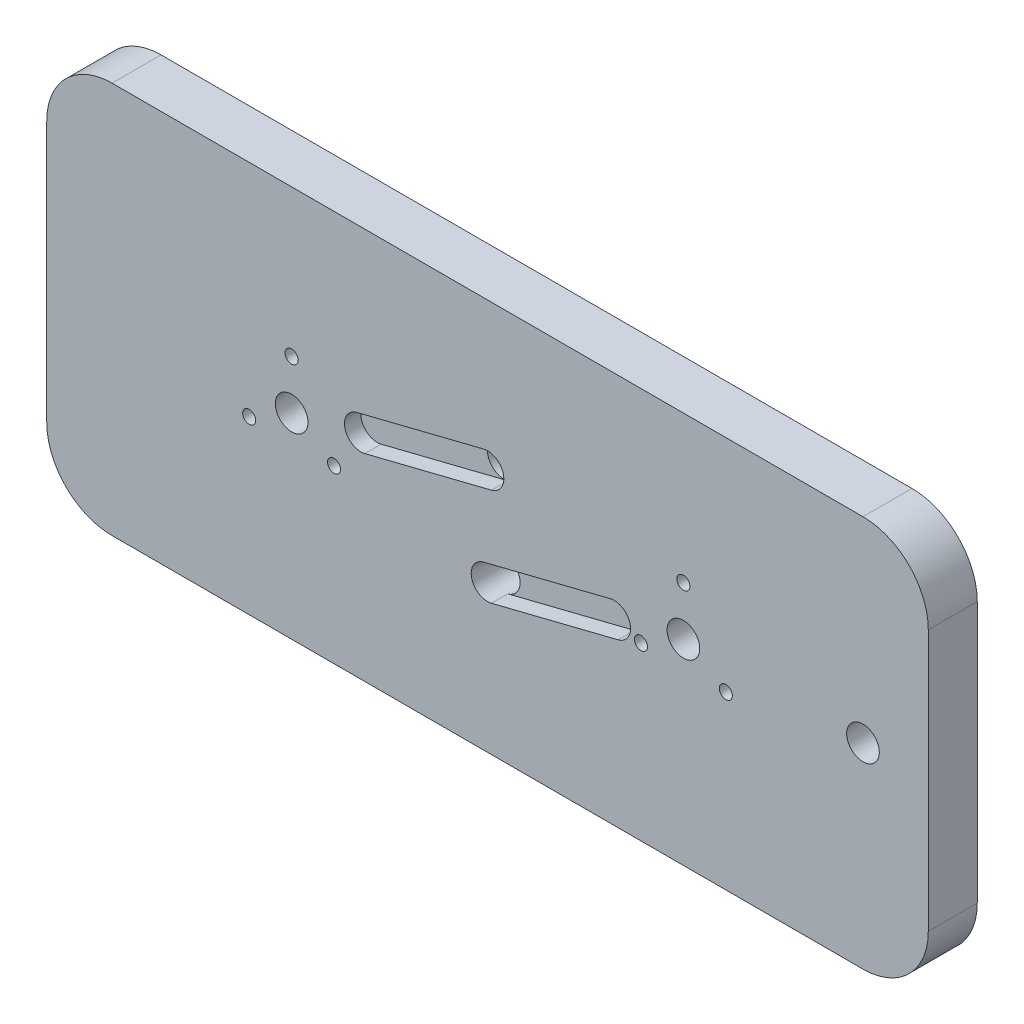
ISO-10303-21;
HEADER;
FILE_DESCRIPTION(('STEP AP214'),'2;1');
FILE_NAME('part.step','',(''),(''),'','','');
FILE_SCHEMA(('AUTOMOTIVE_DESIGN { 1 0 10303 214 1 1 1 1 }'));
ENDSEC;
DATA;
#1=APPLICATION_CONTEXT('core data for automotive mechanical design processes');
#2=APPLICATION_PROTOCOL_DEFINITION('international standard','automotive_design',2000,#1);
#3=PRODUCT_CONTEXT('',#1,'mechanical');
#4=PRODUCT('Part','Part','',(#3));
#5=PRODUCT_RELATED_PRODUCT_CATEGORY('part','',(#4));
#6=PRODUCT_DEFINITION_FORMATION('','',#4);
#7=PRODUCT_DEFINITION_CONTEXT('part definition',#1,'design');
#8=PRODUCT_DEFINITION('design','',#6,#7);
#9=PRODUCT_DEFINITION_SHAPE('','',#8);
#10=(LENGTH_UNIT() NAMED_UNIT(*) SI_UNIT(.MILLI.,.METRE.));
#11=(NAMED_UNIT(*) PLANE_ANGLE_UNIT() SI_UNIT($,.RADIAN.));
#12=(NAMED_UNIT(*) SI_UNIT($,.STERADIAN.) SOLID_ANGLE_UNIT());
#13=UNCERTAINTY_MEASURE_WITH_UNIT(LENGTH_MEASURE(1.E-05),#10,'distance_accuracy_value','');
#14=(GEOMETRIC_REPRESENTATION_CONTEXT(3) GLOBAL_UNCERTAINTY_ASSIGNED_CONTEXT((#13)) GLOBAL_UNIT_ASSIGNED_CONTEXT((#10,
#11,#12)) REPRESENTATION_CONTEXT('',''));
#15=CARTESIAN_POINT('',(0.,0.,0.));
#16=DIRECTION('',(0.,0.,1.));
#17=DIRECTION('',(1.,0.,0.));
#18=AXIS2_PLACEMENT_3D('',#15,#16,#17);
#19=CARTESIAN_POINT('',(-11.5,-4.,0.));
#20=DIRECTION('',(0.,0.,-1.));
#21=DIRECTION('',(-1.,0.,0.));
#22=AXIS2_PLACEMENT_3D('',#19,#20,#21);
#23=PLANE('',#22);
#24=CARTESIAN_POINT('',(-6.,0.,0.));
#25=DIRECTION('',(0.,0.,1.));
#26=DIRECTION('',(1.,0.,0.));
#27=AXIS2_PLACEMENT_3D('',#24,#25,#26);
#28=CIRCLE('',#27,0.500000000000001);
#29=CARTESIAN_POINT('',(-5.5,0.,0.));
#30=VERTEX_POINT('',#29);
#31=EDGE_CURVE('E201',#30,#30,#28,.T.);
#32=ORIENTED_EDGE('',*,*,#31,.T.);
#33=EDGE_LOOP('',(#32));
#34=FACE_BOUND('',#33,.T.);
#35=CARTESIAN_POINT('',(6.,1.5,0.));
#36=DIRECTION('',(0.,0.,1.));
#37=DIRECTION('',(-1.,0.,0.));
#38=AXIS2_PLACEMENT_3D('',#35,#36,#37);
#39=CIRCLE('',#38,0.2);
#40=CARTESIAN_POINT('',(5.8,1.5,0.));
#41=VERTEX_POINT('',#40);
#42=EDGE_CURVE('E213',#41,#41,#39,.T.);
#43=ORIENTED_EDGE('',*,*,#42,.T.);
#44=EDGE_LOOP('',(#43));
#45=FACE_BOUND('',#44,.T.);
#46=CARTESIAN_POINT('',(4.70096189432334,-0.749999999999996,0.));
#47=DIRECTION('',(0.,0.,1.));
#48=DIRECTION('',(-1.,0.,0.));
#49=AXIS2_PLACEMENT_3D('',#46,#47,#48);
#50=CIRCLE('',#49,0.2);
#51=CARTESIAN_POINT('',(4.50096189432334,-0.749999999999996,0.));
#52=VERTEX_POINT('',#51);
#53=EDGE_CURVE('E225',#52,#52,#50,.T.);
#54=ORIENTED_EDGE('',*,*,#53,.T.);
#55=EDGE_LOOP('',(#54));
#56=FACE_BOUND('',#55,.T.);
#57=CARTESIAN_POINT('',(-7.29903810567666,-0.749999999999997,0.));
#58=DIRECTION('',(0.,0.,1.));
#59=DIRECTION('',(1.,0.,0.));
#60=AXIS2_PLACEMENT_3D('',#57,#58,#59);
#61=CIRCLE('',#60,0.200000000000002);
#62=CARTESIAN_POINT('',(-7.09903810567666,-0.749999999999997,0.));
#63=VERTEX_POINT('',#62);
#64=EDGE_CURVE('E237',#63,#63,#61,.T.);
#65=ORIENTED_EDGE('',*,*,#64,.T.);
#66=EDGE_LOOP('',(#65));
#67=FACE_BOUND('',#66,.T.);
#68=CARTESIAN_POINT('',(-11.5,-4.,0.));
#69=DIRECTION('',(0.,0.,1.));
#70=DIRECTION('',(-1.,0.,0.));
#71=AXIS2_PLACEMENT_3D('',#68,#69,#70);
#72=CIRCLE('',#71,2.);
#73=CARTESIAN_POINT('',(-13.5,-4.,0.));
#74=VERTEX_POINT('',#73);
#75=CARTESIAN_POINT('',(-11.5,-6.,0.));
#76=VERTEX_POINT('',#75);
#77=EDGE_CURVE('E259',#74,#76,#72,.T.);
#78=ORIENTED_EDGE('',*,*,#77,.F.);
#79=DIRECTION('',(0.,-1.,0.));
#80=VECTOR('',#79,1.);
#81=CARTESIAN_POINT('',(-13.5,-4.,0.));
#82=LINE('',#81,#80);
#83=CARTESIAN_POINT('',(-13.5,4.,0.));
#84=VERTEX_POINT('',#83);
#85=EDGE_CURVE('E266',#84,#74,#82,.T.);
#86=ORIENTED_EDGE('',*,*,#85,.F.);
#87=CARTESIAN_POINT('',(-11.5,4.,0.));
#88=DIRECTION('',(0.,0.,1.));
#89=DIRECTION('',(-1.,0.,0.));
#90=AXIS2_PLACEMENT_3D('',#87,#88,#89);
#91=CIRCLE('',#90,2.);
#92=CARTESIAN_POINT('',(-11.5,6.,0.));
#93=VERTEX_POINT('',#92);
#94=EDGE_CURVE('E293',#93,#84,#91,.T.);
#95=ORIENTED_EDGE('',*,*,#94,.F.);
#96=DIRECTION('',(-1.,0.,0.));
#97=VECTOR('',#96,1.);
#98=CARTESIAN_POINT('',(-11.5,6.,0.));
#99=LINE('',#98,#97);
#100=CARTESIAN_POINT('',(11.5,6.,0.));
#101=VERTEX_POINT('',#100);
#102=EDGE_CURVE('E291',#101,#93,#99,.T.);
#103=ORIENTED_EDGE('',*,*,#102,.F.);
#104=CARTESIAN_POINT('',(11.5,4.,0.));
#105=DIRECTION('',(0.,0.,1.));
#106=DIRECTION('',(-1.,0.,0.));
#107=AXIS2_PLACEMENT_3D('',#104,#105,#106);
#108=CIRCLE('',#107,2.);
#109=CARTESIAN_POINT('',(13.5,4.,0.));
#110=VERTEX_POINT('',#109);
#111=EDGE_CURVE('E289',#110,#101,#108,.T.);
#112=ORIENTED_EDGE('',*,*,#111,.F.);
#113=DIRECTION('',(0.,1.,0.));
#114=VECTOR('',#113,1.);
#115=CARTESIAN_POINT('',(13.5,-4.,0.));
#116=LINE('',#115,#114);
#117=CARTESIAN_POINT('',(13.5,-4.,0.));
#118=VERTEX_POINT('',#117);
#119=EDGE_CURVE('E287',#118,#110,#116,.T.);
#120=ORIENTED_EDGE('',*,*,#119,.F.);
#121=CARTESIAN_POINT('',(11.5,-4.,0.));
#122=DIRECTION('',(0.,0.,1.));
#123=DIRECTION('',(1.,0.,0.));
#124=AXIS2_PLACEMENT_3D('',#121,#122,#123);
#125=CIRCLE('',#124,2.);
#126=CARTESIAN_POINT('',(11.5,-6.,0.));
#127=VERTEX_POINT('',#126);
#128=EDGE_CURVE('E285',#127,#118,#125,.T.);
#129=ORIENTED_EDGE('',*,*,#128,.F.);
#130=DIRECTION('',(1.,0.,0.));
#131=VECTOR('',#130,1.);
#132=CARTESIAN_POINT('',(-11.5,-6.,0.));
#133=LINE('',#132,#131);
#134=EDGE_CURVE('E283',#76,#127,#133,.T.);
#135=ORIENTED_EDGE('',*,*,#134,.F.);
#136=EDGE_LOOP('',(#78,#86,#95,#103,#112,#120,#129,#135));
#137=FACE_BOUND('',#136,.T.);
#138=CARTESIAN_POINT('',(-6.,1.5,0.));
#139=DIRECTION('',(0.,0.,1.));
#140=DIRECTION('',(1.,0.,0.));
#141=AXIS2_PLACEMENT_3D('',#138,#139,#140);
#142=CIRCLE('',#141,0.2);
#143=CARTESIAN_POINT('',(-5.8,1.5,0.));
#144=VERTEX_POINT('',#143);
#145=EDGE_CURVE('E243',#144,#144,#142,.T.);
#146=ORIENTED_EDGE('',*,*,#145,.T.);
#147=EDGE_LOOP('',(#146));
#148=FACE_BOUND('',#147,.T.);
#149=CARTESIAN_POINT('',(-4.70096189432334,-0.749999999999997,0.));
#150=DIRECTION('',(0.,0.,1.));
#151=DIRECTION('',(1.,0.,0.));
#152=AXIS2_PLACEMENT_3D('',#149,#150,#151);
#153=CIRCLE('',#152,0.2);
#154=CARTESIAN_POINT('',(-4.50096189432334,-0.749999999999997,0.));
#155=VERTEX_POINT('',#154);
#156=EDGE_CURVE('E231',#155,#155,#153,.T.);
#157=ORIENTED_EDGE('',*,*,#156,.T.);
#158=EDGE_LOOP('',(#157));
#159=FACE_BOUND('',#158,.T.);
#160=CARTESIAN_POINT('',(7.29903810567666,-0.749999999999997,0.));
#161=DIRECTION('',(0.,0.,1.));
#162=DIRECTION('',(-1.,0.,0.));
#163=AXIS2_PLACEMENT_3D('',#160,#161,#162);
#164=CIRCLE('',#163,0.200000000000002);
#165=CARTESIAN_POINT('',(7.09903810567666,-0.749999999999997,0.));
#166=VERTEX_POINT('',#165);
#167=EDGE_CURVE('E219',#166,#166,#164,.T.);
#168=ORIENTED_EDGE('',*,*,#167,.T.);
#169=EDGE_LOOP('',(#168));
#170=FACE_BOUND('',#169,.T.);
#171=CARTESIAN_POINT('',(6.,0.,0.));
#172=DIRECTION('',(0.,0.,1.));
#173=DIRECTION('',(1.,0.,0.));
#174=AXIS2_PLACEMENT_3D('',#171,#172,#173);
#175=CIRCLE('',#174,0.500000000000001);
#176=CARTESIAN_POINT('',(6.5,0.,0.));
#177=VERTEX_POINT('',#176);
#178=EDGE_CURVE('E207',#177,#177,#175,.T.);
#179=ORIENTED_EDGE('',*,*,#178,.T.);
#180=EDGE_LOOP('',(#179));
#181=FACE_BOUND('',#180,.T.);
#182=CARTESIAN_POINT('',(11.5,0.,0.));
#183=DIRECTION('',(0.,0.,1.));
#184=DIRECTION('',(1.,0.,0.));
#185=AXIS2_PLACEMENT_3D('',#182,#183,#184);
#186=CIRCLE('',#185,0.500000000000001);
#187=CARTESIAN_POINT('',(12.,0.,0.));
#188=VERTEX_POINT('',#187);
#189=EDGE_CURVE('E192',#188,#188,#186,.T.);
#190=ORIENTED_EDGE('',*,*,#189,.T.);
#191=EDGE_LOOP('',(#190));
#192=FACE_BOUND('',#191,.T.);
#193=CARTESIAN_POINT('',(0.,0.,0.));
#194=DIRECTION('',(0.,0.,-1.));
#195=DIRECTION('',(-1.,0.,0.));
#196=AXIS2_PLACEMENT_3D('',#193,#194,#195);
#197=CIRCLE('',#196,3.5);
#198=CARTESIAN_POINT('',(-3.5,0.,0.));
#199=VERTEX_POINT('',#198);
#200=EDGE_CURVE('E367',#199,#199,#197,.T.);
#201=ORIENTED_EDGE('',*,*,#200,.F.);
#202=EDGE_LOOP('',(#201));
#203=FACE_BOUND('',#202,.T.);
#204=ADVANCED_FACE('F31',(#34,#45,#56,#67,#137,#148,#159,#170,#181,#192,#203),#23,.T.);
#205=CARTESIAN_POINT('',(-11.5,-4.,1.5));
#206=DIRECTION('',(0.,0.,-1.));
#207=DIRECTION('',(-1.,0.,0.));
#208=AXIS2_PLACEMENT_3D('',#205,#206,#207);
#209=PLANE('',#208);
#210=CARTESIAN_POINT('',(-6.,0.,1.5));
#211=DIRECTION('',(0.,0.,1.));
#212=DIRECTION('',(1.,0.,0.));
#213=AXIS2_PLACEMENT_3D('',#210,#211,#212);
#214=CIRCLE('',#213,0.500000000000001);
#215=CARTESIAN_POINT('',(-5.5,0.,1.5));
#216=VERTEX_POINT('',#215);
#217=EDGE_CURVE('E204',#216,#216,#214,.T.);
#218=ORIENTED_EDGE('',*,*,#217,.F.);
#219=EDGE_LOOP('',(#218));
#220=FACE_BOUND('',#219,.T.);
#221=CARTESIAN_POINT('',(6.,1.5,1.5));
#222=DIRECTION('',(0.,0.,1.));
#223=DIRECTION('',(-1.,0.,0.));
#224=AXIS2_PLACEMENT_3D('',#221,#222,#223);
#225=CIRCLE('',#224,0.2);
#226=CARTESIAN_POINT('',(5.8,1.5,1.5));
#227=VERTEX_POINT('',#226);
#228=EDGE_CURVE('E216',#227,#227,#225,.T.);
#229=ORIENTED_EDGE('',*,*,#228,.F.);
#230=EDGE_LOOP('',(#229));
#231=FACE_BOUND('',#230,.T.);
#232=CARTESIAN_POINT('',(4.70096189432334,-0.749999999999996,1.5));
#233=DIRECTION('',(0.,0.,1.));
#234=DIRECTION('',(-1.,0.,0.));
#235=AXIS2_PLACEMENT_3D('',#232,#233,#234);
#236=CIRCLE('',#235,0.2);
#237=CARTESIAN_POINT('',(4.50096189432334,-0.749999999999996,1.5));
#238=VERTEX_POINT('',#237);
#239=EDGE_CURVE('E228',#238,#238,#236,.T.);
#240=ORIENTED_EDGE('',*,*,#239,.F.);
#241=EDGE_LOOP('',(#240));
#242=FACE_BOUND('',#241,.T.);
#243=CARTESIAN_POINT('',(-7.29903810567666,-0.749999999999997,1.5));
#244=DIRECTION('',(0.,0.,1.));
#245=DIRECTION('',(1.,0.,0.));
#246=AXIS2_PLACEMENT_3D('',#243,#244,#245);
#247=CIRCLE('',#246,0.200000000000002);
#248=CARTESIAN_POINT('',(-7.09903810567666,-0.749999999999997,1.5));
#249=VERTEX_POINT('',#248);
#250=EDGE_CURVE('E240',#249,#249,#247,.T.);
#251=ORIENTED_EDGE('',*,*,#250,.F.);
#252=EDGE_LOOP('',(#251));
#253=FACE_BOUND('',#252,.T.);
#254=CARTESIAN_POINT('',(0.,-1.5,1.5));
#255=DIRECTION('',(0.,0.,1.));
#256=DIRECTION('',(1.,0.,0.));
#257=AXIS2_PLACEMENT_3D('',#254,#255,#256);
#258=CIRCLE('',#257,0.5);
#259=CARTESIAN_POINT('',(-0.121267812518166,-1.01492874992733,1.5));
#260=VERTEX_POINT('',#259);
#261=CARTESIAN_POINT('',(0.121267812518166,-1.98507125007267,1.5));
#262=VERTEX_POINT('',#261);
#263=EDGE_CURVE('E166',#260,#262,#258,.T.);
#264=ORIENTED_EDGE('',*,*,#263,.F.);
#265=DIRECTION('',(-0.970142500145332,-0.242535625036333,0.));
#266=VECTOR('',#265,1.);
#267=CARTESIAN_POINT('',(-0.121267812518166,-1.01492874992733,1.5));
#268=LINE('',#267,#266);
#269=CARTESIAN_POINT('',(3.75930218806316,-0.0447862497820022,1.5));
#270=VERTEX_POINT('',#269);
#271=EDGE_CURVE('E160',#270,#260,#268,.T.);
#272=ORIENTED_EDGE('',*,*,#271,.F.);
#273=CARTESIAN_POINT('',(3.88057000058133,-0.529857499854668,1.5));
#274=DIRECTION('',(0.,0.,1.));
#275=DIRECTION('',(1.,0.,0.));
#276=AXIS2_PLACEMENT_3D('',#273,#274,#275);
#277=CIRCLE('',#276,0.5);
#278=CARTESIAN_POINT('',(4.00183781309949,-1.01492874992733,1.5));
#279=VERTEX_POINT('',#278);
#280=EDGE_CURVE('E380',#279,#270,#277,.T.);
#281=ORIENTED_EDGE('',*,*,#280,.F.);
#282=DIRECTION('',(0.970142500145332,0.242535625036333,0.));
#283=VECTOR('',#282,1.);
#284=CARTESIAN_POINT('',(0.121267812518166,-1.98507125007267,1.5));
#285=LINE('',#284,#283);
#286=EDGE_CURVE('E373',#262,#279,#285,.T.);
#287=ORIENTED_EDGE('',*,*,#286,.F.);
#288=EDGE_LOOP('',(#264,#272,#281,#287));
#289=FACE_BOUND('',#288,.T.);
#290=CARTESIAN_POINT('',(-11.5,-4.,1.5));
#291=DIRECTION('',(0.,0.,1.));
#292=DIRECTION('',(-1.,0.,0.));
#293=AXIS2_PLACEMENT_3D('',#290,#291,#292);
#294=CIRCLE('',#293,2.);
#295=CARTESIAN_POINT('',(-13.5,-4.,1.5));
#296=VERTEX_POINT('',#295);
#297=CARTESIAN_POINT('',(-11.5,-6.,1.5));
#298=VERTEX_POINT('',#297);
#299=EDGE_CURVE('E262',#296,#298,#294,.T.);
#300=ORIENTED_EDGE('',*,*,#299,.T.);
#301=DIRECTION('',(1.,0.,0.));
#302=VECTOR('',#301,1.);
#303=CARTESIAN_POINT('',(-11.5,-6.,1.5));
#304=LINE('',#303,#302);
#305=CARTESIAN_POINT('',(11.5,-6.,1.5));
#306=VERTEX_POINT('',#305);
#307=EDGE_CURVE('E265',#298,#306,#304,.T.);
#308=ORIENTED_EDGE('',*,*,#307,.T.);
#309=CARTESIAN_POINT('',(11.5,-4.,1.5));
#310=DIRECTION('',(0.,0.,1.));
#311=DIRECTION('',(1.,0.,0.));
#312=AXIS2_PLACEMENT_3D('',#309,#310,#311);
#313=CIRCLE('',#312,2.);
#314=CARTESIAN_POINT('',(13.5,-4.,1.5));
#315=VERTEX_POINT('',#314);
#316=EDGE_CURVE('E268',#306,#315,#313,.T.);
#317=ORIENTED_EDGE('',*,*,#316,.T.);
#318=DIRECTION('',(0.,1.,0.));
#319=VECTOR('',#318,1.);
#320=CARTESIAN_POINT('',(13.5,-4.,1.5));
#321=LINE('',#320,#319);
#322=CARTESIAN_POINT('',(13.5,4.,1.5));
#323=VERTEX_POINT('',#322);
#324=EDGE_CURVE('E270',#315,#323,#321,.T.);
#325=ORIENTED_EDGE('',*,*,#324,.T.);
#326=CARTESIAN_POINT('',(11.5,4.,1.5));
#327=DIRECTION('',(0.,0.,1.));
#328=DIRECTION('',(-1.,0.,0.));
#329=AXIS2_PLACEMENT_3D('',#326,#327,#328);
#330=CIRCLE('',#329,2.);
#331=CARTESIAN_POINT('',(11.5,6.,1.5));
#332=VERTEX_POINT('',#331);
#333=EDGE_CURVE('E272',#323,#332,#330,.T.);
#334=ORIENTED_EDGE('',*,*,#333,.T.);
#335=DIRECTION('',(-1.,0.,0.));
#336=VECTOR('',#335,1.);
#337=CARTESIAN_POINT('',(-11.5,6.,1.5));
#338=LINE('',#337,#336);
#339=CARTESIAN_POINT('',(-11.5,6.,1.5));
#340=VERTEX_POINT('',#339);
#341=EDGE_CURVE('E274',#332,#340,#338,.T.);
#342=ORIENTED_EDGE('',*,*,#341,.T.);
#343=CARTESIAN_POINT('',(-11.5,4.,1.5));
#344=DIRECTION('',(0.,0.,1.));
#345=DIRECTION('',(-1.,0.,0.));
#346=AXIS2_PLACEMENT_3D('',#343,#344,#345);
#347=CIRCLE('',#346,2.);
#348=CARTESIAN_POINT('',(-13.5,4.,1.5));
#349=VERTEX_POINT('',#348);
#350=EDGE_CURVE('E276',#340,#349,#347,.T.);
#351=ORIENTED_EDGE('',*,*,#350,.T.);
#352=DIRECTION('',(0.,-1.,0.));
#353=VECTOR('',#352,1.);
#354=CARTESIAN_POINT('',(-13.5,-4.,1.5));
#355=LINE('',#354,#353);
#356=EDGE_CURVE('E278',#349,#296,#355,.T.);
#357=ORIENTED_EDGE('',*,*,#356,.T.);
#358=EDGE_LOOP('',(#300,#308,#317,#325,#334,#342,#351,#357));
#359=FACE_BOUND('',#358,.T.);
#360=CARTESIAN_POINT('',(0.,1.5,1.5));
#361=DIRECTION('',(0.,0.,1.));
#362=DIRECTION('',(1.,0.,0.));
#363=AXIS2_PLACEMENT_3D('',#360,#361,#362);
#364=CIRCLE('',#363,0.5);
#365=CARTESIAN_POINT('',(0.121267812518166,1.01492874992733,1.5));
#366=VERTEX_POINT('',#365);
#367=CARTESIAN_POINT('',(-0.121267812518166,1.98507125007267,1.5));
#368=VERTEX_POINT('',#367);
#369=EDGE_CURVE('E256',#366,#368,#364,.T.);
#370=ORIENTED_EDGE('',*,*,#369,.F.);
#371=DIRECTION('',(0.970142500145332,0.242535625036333,0.));
#372=VECTOR('',#371,1.);
#373=CARTESIAN_POINT('',(0.121267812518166,1.01492874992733,1.5));
#374=LINE('',#373,#372);
#375=CARTESIAN_POINT('',(-3.75930218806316,0.0447862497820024,1.5));
#376=VERTEX_POINT('',#375);
#377=EDGE_CURVE('E177',#376,#366,#374,.T.);
#378=ORIENTED_EDGE('',*,*,#377,.F.);
#379=CARTESIAN_POINT('',(-3.88057000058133,0.529857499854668,1.5));
#380=DIRECTION('',(0.,0.,1.));
#381=DIRECTION('',(1.,0.,0.));
#382=AXIS2_PLACEMENT_3D('',#379,#380,#381);
#383=CIRCLE('',#382,0.5);
#384=CARTESIAN_POINT('',(-4.00183781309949,1.01492874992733,1.5));
#385=VERTEX_POINT('',#384);
#386=EDGE_CURVE('E184',#385,#376,#383,.T.);
#387=ORIENTED_EDGE('',*,*,#386,.F.);
#388=DIRECTION('',(-0.970142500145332,-0.242535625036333,0.));
#389=VECTOR('',#388,1.);
#390=CARTESIAN_POINT('',(-0.121267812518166,1.98507125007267,1.5));
#391=LINE('',#390,#389);
#392=EDGE_CURVE('E181',#368,#385,#391,.T.);
#393=ORIENTED_EDGE('',*,*,#392,.F.);
#394=EDGE_LOOP('',(#370,#378,#387,#393));
#395=FACE_BOUND('',#394,.T.);
#396=CARTESIAN_POINT('',(-6.,1.5,1.5));
#397=DIRECTION('',(0.,0.,1.));
#398=DIRECTION('',(1.,0.,0.));
#399=AXIS2_PLACEMENT_3D('',#396,#397,#398);
#400=CIRCLE('',#399,0.2);
#401=CARTESIAN_POINT('',(-5.8,1.5,1.5));
#402=VERTEX_POINT('',#401);
#403=EDGE_CURVE('E246',#402,#402,#400,.T.);
#404=ORIENTED_EDGE('',*,*,#403,.F.);
#405=EDGE_LOOP('',(#404));
#406=FACE_BOUND('',#405,.T.);
#407=CARTESIAN_POINT('',(-4.70096189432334,-0.749999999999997,1.5));
#408=DIRECTION('',(0.,0.,1.));
#409=DIRECTION('',(1.,0.,0.));
#410=AXIS2_PLACEMENT_3D('',#407,#408,#409);
#411=CIRCLE('',#410,0.2);
#412=CARTESIAN_POINT('',(-4.50096189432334,-0.749999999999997,1.5));
#413=VERTEX_POINT('',#412);
#414=EDGE_CURVE('E234',#413,#413,#411,.T.);
#415=ORIENTED_EDGE('',*,*,#414,.F.);
#416=EDGE_LOOP('',(#415));
#417=FACE_BOUND('',#416,.T.);
#418=CARTESIAN_POINT('',(7.29903810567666,-0.749999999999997,1.5));
#419=DIRECTION('',(0.,0.,1.));
#420=DIRECTION('',(-1.,0.,0.));
#421=AXIS2_PLACEMENT_3D('',#418,#419,#420);
#422=CIRCLE('',#421,0.200000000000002);
#423=CARTESIAN_POINT('',(7.09903810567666,-0.749999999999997,1.5));
#424=VERTEX_POINT('',#423);
#425=EDGE_CURVE('E222',#424,#424,#422,.T.);
#426=ORIENTED_EDGE('',*,*,#425,.F.);
#427=EDGE_LOOP('',(#426));
#428=FACE_BOUND('',#427,.T.);
#429=CARTESIAN_POINT('',(6.,0.,1.5));
#430=DIRECTION('',(0.,0.,1.));
#431=DIRECTION('',(1.,0.,0.));
#432=AXIS2_PLACEMENT_3D('',#429,#430,#431);
#433=CIRCLE('',#432,0.500000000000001);
#434=CARTESIAN_POINT('',(6.5,0.,1.5));
#435=VERTEX_POINT('',#434);
#436=EDGE_CURVE('E210',#435,#435,#433,.T.);
#437=ORIENTED_EDGE('',*,*,#436,.F.);
#438=EDGE_LOOP('',(#437));
#439=FACE_BOUND('',#438,.T.);
#440=CARTESIAN_POINT('',(11.5,0.,1.5));
#441=DIRECTION('',(0.,0.,1.));
#442=DIRECTION('',(1.,0.,0.));
#443=AXIS2_PLACEMENT_3D('',#440,#441,#442);
#444=CIRCLE('',#443,0.500000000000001);
#445=CARTESIAN_POINT('',(12.,0.,1.5));
#446=VERTEX_POINT('',#445);
#447=EDGE_CURVE('E198',#446,#446,#444,.T.);
#448=ORIENTED_EDGE('',*,*,#447,.F.);
#449=EDGE_LOOP('',(#448));
#450=FACE_BOUND('',#449,.T.);
#451=ADVANCED_FACE('F338',(#220,#231,#242,#253,#289,#359,#395,#406,#417,#428,#439,#450),#209,.F.);
#452=CARTESIAN_POINT('',(0.,0.,0.));
#453=DIRECTION('',(0.,0.,-1.));
#454=DIRECTION('',(-1.,0.,0.));
#455=AXIS2_PLACEMENT_3D('',#452,#453,#454);
#456=CIRCLE('',#455,3.);
#457=CARTESIAN_POINT('',(-3.,0.,0.));
#458=VERTEX_POINT('',#457);
#459=EDGE_CURVE('E11',#458,#458,#456,.F.);
#460=ORIENTED_EDGE('',*,*,#459,.F.);
#461=EDGE_LOOP('',(#460));
#462=FACE_BOUND('',#461,.T.);
#463=CARTESIAN_POINT('',(0.,-1.5,0.));
#464=DIRECTION('',(0.,0.,1.));
#465=DIRECTION('',(1.,0.,0.));
#466=AXIS2_PLACEMENT_3D('',#463,#464,#465);
#467=CIRCLE('',#466,0.5);
#468=CARTESIAN_POINT('',(0.5,-1.5,0.));
#469=VERTEX_POINT('',#468);
#470=EDGE_CURVE('E249',#469,#469,#467,.T.);
#471=ORIENTED_EDGE('',*,*,#470,.T.);
#472=EDGE_LOOP('',(#471));
#473=FACE_BOUND('',#472,.T.);
#474=CARTESIAN_POINT('',(0.,1.5,0.));
#475=DIRECTION('',(0.,0.,1.));
#476=DIRECTION('',(1.,0.,0.));
#477=AXIS2_PLACEMENT_3D('',#474,#475,#476);
#478=CIRCLE('',#477,0.5);
#479=CARTESIAN_POINT('',(0.5,1.5,0.));
#480=VERTEX_POINT('',#479);
#481=EDGE_CURVE('E253',#480,#480,#478,.T.);
#482=ORIENTED_EDGE('',*,*,#481,.T.);
#483=EDGE_LOOP('',(#482));
#484=FACE_BOUND('',#483,.T.);
#485=ADVANCED_FACE('F341',(#462,#473,#484),#23,.T.);
#486=CARTESIAN_POINT('',(-11.5,-4.,1.5));
#487=DIRECTION('',(0.,0.,-1.));
#488=DIRECTION('',(-1.,0.,0.));
#489=AXIS2_PLACEMENT_3D('',#486,#487,#488);
#490=CYLINDRICAL_SURFACE('',#489,2.);
#491=ORIENTED_EDGE('',*,*,#77,.T.);
#492=DIRECTION('',(0.,0.,-1.));
#493=VECTOR('',#492,1.);
#494=CARTESIAN_POINT('',(-11.5,-6.,1.5));
#495=LINE('',#494,#493);
#496=EDGE_CURVE('E316',#298,#76,#495,.T.);
#497=ORIENTED_EDGE('',*,*,#496,.F.);
#498=ORIENTED_EDGE('',*,*,#299,.F.);
#499=DIRECTION('',(0.,0.,-1.));
#500=VECTOR('',#499,1.);
#501=CARTESIAN_POINT('',(-13.5,-4.,1.5));
#502=LINE('',#501,#500);
#503=EDGE_CURVE('E280',#296,#74,#502,.T.);
#504=ORIENTED_EDGE('',*,*,#503,.T.);
#505=EDGE_LOOP('',(#491,#497,#498,#504));
#506=FACE_BOUND('',#505,.T.);
#507=ADVANCED_FACE('F33',(#506),#490,.T.);
#508=CARTESIAN_POINT('',(-11.5,-6.,1.5));
#509=DIRECTION('',(0.,1.,0.));
#510=DIRECTION('',(0.,0.,1.));
#511=AXIS2_PLACEMENT_3D('',#508,#509,#510);
#512=PLANE('',#511);
#513=ORIENTED_EDGE('',*,*,#134,.T.);
#514=DIRECTION('',(0.,0.,-1.));
#515=VECTOR('',#514,1.);
#516=CARTESIAN_POINT('',(11.5,-6.,1.5));
#517=LINE('',#516,#515);
#518=EDGE_CURVE('E313',#306,#127,#517,.T.);
#519=ORIENTED_EDGE('',*,*,#518,.F.);
#520=ORIENTED_EDGE('',*,*,#307,.F.);
#521=ORIENTED_EDGE('',*,*,#496,.T.);
#522=EDGE_LOOP('',(#513,#519,#520,#521));
#523=FACE_BOUND('',#522,.T.);
#524=ADVANCED_FACE('F400',(#523),#512,.F.);
#525=CARTESIAN_POINT('',(11.5,-4.,1.5));
#526=DIRECTION('',(0.,0.,-1.));
#527=DIRECTION('',(-1.,0.,0.));
#528=AXIS2_PLACEMENT_3D('',#525,#526,#527);
#529=CYLINDRICAL_SURFACE('',#528,2.);
#530=ORIENTED_EDGE('',*,*,#128,.T.);
#531=DIRECTION('',(0.,0.,-1.));
#532=VECTOR('',#531,1.);
#533=CARTESIAN_POINT('',(13.5,-4.,1.5));
#534=LINE('',#533,#532);
#535=EDGE_CURVE('E310',#315,#118,#534,.T.);
#536=ORIENTED_EDGE('',*,*,#535,.F.);
#537=ORIENTED_EDGE('',*,*,#316,.F.);
#538=ORIENTED_EDGE('',*,*,#518,.T.);
#539=EDGE_LOOP('',(#530,#536,#537,#538));
#540=FACE_BOUND('',#539,.T.);
#541=ADVANCED_FACE('F405',(#540),#529,.T.);
#542=CARTESIAN_POINT('',(13.5,-4.,1.5));
#543=DIRECTION('',(-1.,0.,0.));
#544=DIRECTION('',(0.,0.,1.));
#545=AXIS2_PLACEMENT_3D('',#542,#543,#544);
#546=PLANE('',#545);
#547=ORIENTED_EDGE('',*,*,#119,.T.);
#548=DIRECTION('',(0.,0.,-1.));
#549=VECTOR('',#548,1.);
#550=CARTESIAN_POINT('',(13.5,4.,1.5));
#551=LINE('',#550,#549);
#552=EDGE_CURVE('E307',#323,#110,#551,.T.);
#553=ORIENTED_EDGE('',*,*,#552,.F.);
#554=ORIENTED_EDGE('',*,*,#324,.F.);
#555=ORIENTED_EDGE('',*,*,#535,.T.);
#556=EDGE_LOOP('',(#547,#553,#554,#555));
#557=FACE_BOUND('',#556,.T.);
#558=ADVANCED_FACE('F411',(#557),#546,.F.);
#559=CARTESIAN_POINT('',(11.5,4.,1.5));
#560=DIRECTION('',(0.,0.,-1.));
#561=DIRECTION('',(-1.,0.,0.));
#562=AXIS2_PLACEMENT_3D('',#559,#560,#561);
#563=CYLINDRICAL_SURFACE('',#562,2.);
#564=ORIENTED_EDGE('',*,*,#111,.T.);
#565=DIRECTION('',(0.,0.,-1.));
#566=VECTOR('',#565,1.);
#567=CARTESIAN_POINT('',(11.5,6.,1.5));
#568=LINE('',#567,#566);
#569=EDGE_CURVE('E304',#332,#101,#568,.T.);
#570=ORIENTED_EDGE('',*,*,#569,.F.);
#571=ORIENTED_EDGE('',*,*,#333,.F.);
#572=ORIENTED_EDGE('',*,*,#552,.T.);
#573=EDGE_LOOP('',(#564,#570,#571,#572));
#574=FACE_BOUND('',#573,.T.);
#575=ADVANCED_FACE('F415',(#574),#563,.T.);
#576=CARTESIAN_POINT('',(-11.5,6.,1.5));
#577=DIRECTION('',(0.,-1.,0.));
#578=DIRECTION('',(0.,0.,-1.));
#579=AXIS2_PLACEMENT_3D('',#576,#577,#578);
#580=PLANE('',#579);
#581=ORIENTED_EDGE('',*,*,#102,.T.);
#582=DIRECTION('',(0.,0.,-1.));
#583=VECTOR('',#582,1.);
#584=CARTESIAN_POINT('',(-11.5,6.,1.5));
#585=LINE('',#584,#583);
#586=EDGE_CURVE('E301',#340,#93,#585,.T.);
#587=ORIENTED_EDGE('',*,*,#586,.F.);
#588=ORIENTED_EDGE('',*,*,#341,.F.);
#589=ORIENTED_EDGE('',*,*,#569,.T.);
#590=EDGE_LOOP('',(#581,#587,#588,#589));
#591=FACE_BOUND('',#590,.T.);
#592=ADVANCED_FACE('F420',(#591),#580,.F.);
#593=CARTESIAN_POINT('',(-11.5,4.,1.5));
#594=DIRECTION('',(0.,0.,-1.));
#595=DIRECTION('',(-1.,0.,0.));
#596=AXIS2_PLACEMENT_3D('',#593,#594,#595);
#597=CYLINDRICAL_SURFACE('',#596,2.);
#598=ORIENTED_EDGE('',*,*,#94,.T.);
#599=DIRECTION('',(0.,0.,-1.));
#600=VECTOR('',#599,1.);
#601=CARTESIAN_POINT('',(-13.5,4.,1.5));
#602=LINE('',#601,#600);
#603=EDGE_CURVE('E298',#349,#84,#602,.T.);
#604=ORIENTED_EDGE('',*,*,#603,.F.);
#605=ORIENTED_EDGE('',*,*,#350,.F.);
#606=ORIENTED_EDGE('',*,*,#586,.T.);
#607=EDGE_LOOP('',(#598,#604,#605,#606));
#608=FACE_BOUND('',#607,.T.);
#609=ADVANCED_FACE('F424',(#608),#597,.T.);
#610=CARTESIAN_POINT('',(-13.5,-4.,1.5));
#611=DIRECTION('',(1.,0.,0.));
#612=DIRECTION('',(0.,0.,-1.));
#613=AXIS2_PLACEMENT_3D('',#610,#611,#612);
#614=PLANE('',#613);
#615=ORIENTED_EDGE('',*,*,#85,.T.);
#616=ORIENTED_EDGE('',*,*,#503,.F.);
#617=ORIENTED_EDGE('',*,*,#356,.F.);
#618=ORIENTED_EDGE('',*,*,#603,.T.);
#619=EDGE_LOOP('',(#615,#616,#617,#618));
#620=FACE_BOUND('',#619,.T.);
#621=ADVANCED_FACE('F428',(#620),#614,.F.);
#622=CARTESIAN_POINT('',(0.,1.5,1.5));
#623=DIRECTION('',(0.,0.,-1.));
#624=DIRECTION('',(-1.,0.,0.));
#625=AXIS2_PLACEMENT_3D('',#622,#623,#624);
#626=CYLINDRICAL_SURFACE('',#625,0.5);
#627=DIRECTION('',(0.,0.,1.));
#628=VECTOR('',#627,1.);
#629=CARTESIAN_POINT('',(0.121267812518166,1.01492874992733,1.));
#630=LINE('',#629,#628);
#631=CARTESIAN_POINT('',(0.121267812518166,1.01492874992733,1.));
#632=VERTEX_POINT('',#631);
#633=EDGE_CURVE('E189',#632,#366,#630,.T.);
#634=ORIENTED_EDGE('',*,*,#633,.T.);
#635=ORIENTED_EDGE('',*,*,#369,.T.);
#636=DIRECTION('',(0.,0.,1.));
#637=VECTOR('',#636,1.);
#638=CARTESIAN_POINT('',(-0.121267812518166,1.98507125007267,1.));
#639=LINE('',#638,#637);
#640=CARTESIAN_POINT('',(-0.121267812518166,1.98507125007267,1.));
#641=VERTEX_POINT('',#640);
#642=EDGE_CURVE('E180',#641,#368,#639,.T.);
#643=ORIENTED_EDGE('',*,*,#642,.F.);
#644=CARTESIAN_POINT('',(0.,1.5,1.));
#645=DIRECTION('',(0.,0.,1.));
#646=DIRECTION('',(1.,0.,0.));
#647=AXIS2_PLACEMENT_3D('',#644,#645,#646);
#648=CIRCLE('',#647,0.5);
#649=EDGE_CURVE('E151',#641,#632,#648,.T.);
#650=ORIENTED_EDGE('',*,*,#649,.T.);
#651=EDGE_LOOP('',(#634,#635,#643,#650));
#652=FACE_BOUND('',#651,.T.);
#653=ORIENTED_EDGE('',*,*,#481,.F.);
#654=EDGE_LOOP('',(#653));
#655=FACE_BOUND('',#654,.T.);
#656=ADVANCED_FACE('F322',(#652,#655),#626,.F.);
#657=CARTESIAN_POINT('',(0.,-1.5,1.5));
#658=DIRECTION('',(0.,0.,-1.));
#659=DIRECTION('',(-1.,0.,0.));
#660=AXIS2_PLACEMENT_3D('',#657,#658,#659);
#661=CYLINDRICAL_SURFACE('',#660,0.5);
#662=DIRECTION('',(0.,0.,1.));
#663=VECTOR('',#662,1.);
#664=CARTESIAN_POINT('',(-0.121267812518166,-1.01492874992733,1.));
#665=LINE('',#664,#663);
#666=CARTESIAN_POINT('',(-0.121267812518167,-1.01492874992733,1.));
#667=VERTEX_POINT('',#666);
#668=EDGE_CURVE('E185',#667,#260,#665,.T.);
#669=ORIENTED_EDGE('',*,*,#668,.T.);
#670=ORIENTED_EDGE('',*,*,#263,.T.);
#671=DIRECTION('',(0.,0.,1.));
#672=VECTOR('',#671,1.);
#673=CARTESIAN_POINT('',(0.121267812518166,-1.98507125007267,1.));
#674=LINE('',#673,#672);
#675=CARTESIAN_POINT('',(0.121267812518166,-1.98507125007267,1.));
#676=VERTEX_POINT('',#675);
#677=EDGE_CURVE('E155',#676,#262,#674,.T.);
#678=ORIENTED_EDGE('',*,*,#677,.F.);
#679=CARTESIAN_POINT('',(0.,-1.5,1.));
#680=DIRECTION('',(0.,0.,1.));
#681=DIRECTION('',(1.,0.,0.));
#682=AXIS2_PLACEMENT_3D('',#679,#680,#681);
#683=CIRCLE('',#682,0.5);
#684=EDGE_CURVE('E39',#676,#667,#683,.T.);
#685=ORIENTED_EDGE('',*,*,#684,.T.);
#686=EDGE_LOOP('',(#669,#670,#678,#685));
#687=FACE_BOUND('',#686,.T.);
#688=ORIENTED_EDGE('',*,*,#470,.F.);
#689=EDGE_LOOP('',(#688));
#690=FACE_BOUND('',#689,.T.);
#691=ADVANCED_FACE('F163',(#687,#690),#661,.F.);
#692=CARTESIAN_POINT('',(-6.,1.5,1.5));
#693=DIRECTION('',(0.,0.,-1.));
#694=DIRECTION('',(-1.,0.,0.));
#695=AXIS2_PLACEMENT_3D('',#692,#693,#694);
#696=CYLINDRICAL_SURFACE('',#695,0.2);
#697=ORIENTED_EDGE('',*,*,#403,.T.);
#698=EDGE_LOOP('',(#697));
#699=FACE_BOUND('',#698,.T.);
#700=ORIENTED_EDGE('',*,*,#145,.F.);
#701=EDGE_LOOP('',(#700));
#702=FACE_BOUND('',#701,.T.);
#703=ADVANCED_FACE('F468',(#699,#702),#696,.F.);
#704=CARTESIAN_POINT('',(-7.29903810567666,-0.749999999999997,1.5));
#705=DIRECTION('',(0.,0.,-1.));
#706=DIRECTION('',(-1.,0.,0.));
#707=AXIS2_PLACEMENT_3D('',#704,#705,#706);
#708=CYLINDRICAL_SURFACE('',#707,0.200000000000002);
#709=ORIENTED_EDGE('',*,*,#250,.T.);
#710=EDGE_LOOP('',(#709));
#711=FACE_BOUND('',#710,.T.);
#712=ORIENTED_EDGE('',*,*,#64,.F.);
#713=EDGE_LOOP('',(#712));
#714=FACE_BOUND('',#713,.T.);
#715=ADVANCED_FACE('F464',(#711,#714),#708,.F.);
#716=CARTESIAN_POINT('',(-4.70096189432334,-0.749999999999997,1.5));
#717=DIRECTION('',(0.,0.,-1.));
#718=DIRECTION('',(-1.,0.,0.));
#719=AXIS2_PLACEMENT_3D('',#716,#717,#718);
#720=CYLINDRICAL_SURFACE('',#719,0.2);
#721=ORIENTED_EDGE('',*,*,#414,.T.);
#722=EDGE_LOOP('',(#721));
#723=FACE_BOUND('',#722,.T.);
#724=ORIENTED_EDGE('',*,*,#156,.F.);
#725=EDGE_LOOP('',(#724));
#726=FACE_BOUND('',#725,.T.);
#727=ADVANCED_FACE('F460',(#723,#726),#720,.F.);
#728=CARTESIAN_POINT('',(4.70096189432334,-0.749999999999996,1.5));
#729=DIRECTION('',(0.,0.,-1.));
#730=DIRECTION('',(-1.,0.,0.));
#731=AXIS2_PLACEMENT_3D('',#728,#729,#730);
#732=CYLINDRICAL_SURFACE('',#731,0.2);
#733=ORIENTED_EDGE('',*,*,#239,.T.);
#734=EDGE_LOOP('',(#733));
#735=FACE_BOUND('',#734,.T.);
#736=ORIENTED_EDGE('',*,*,#53,.F.);
#737=EDGE_LOOP('',(#736));
#738=FACE_BOUND('',#737,.T.);
#739=ADVANCED_FACE('F456',(#735,#738),#732,.F.);
#740=CARTESIAN_POINT('',(7.29903810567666,-0.749999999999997,1.5));
#741=DIRECTION('',(0.,0.,-1.));
#742=DIRECTION('',(-1.,0.,0.));
#743=AXIS2_PLACEMENT_3D('',#740,#741,#742);
#744=CYLINDRICAL_SURFACE('',#743,0.200000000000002);
#745=ORIENTED_EDGE('',*,*,#425,.T.);
#746=EDGE_LOOP('',(#745));
#747=FACE_BOUND('',#746,.T.);
#748=ORIENTED_EDGE('',*,*,#167,.F.);
#749=EDGE_LOOP('',(#748));
#750=FACE_BOUND('',#749,.T.);
#751=ADVANCED_FACE('F450',(#747,#750),#744,.F.);
#752=CARTESIAN_POINT('',(6.,1.5,1.5));
#753=DIRECTION('',(0.,0.,-1.));
#754=DIRECTION('',(-1.,0.,0.));
#755=AXIS2_PLACEMENT_3D('',#752,#753,#754);
#756=CYLINDRICAL_SURFACE('',#755,0.2);
#757=ORIENTED_EDGE('',*,*,#228,.T.);
#758=EDGE_LOOP('',(#757));
#759=FACE_BOUND('',#758,.T.);
#760=ORIENTED_EDGE('',*,*,#42,.F.);
#761=EDGE_LOOP('',(#760));
#762=FACE_BOUND('',#761,.T.);
#763=ADVANCED_FACE('F441',(#759,#762),#756,.F.);
#764=CARTESIAN_POINT('',(6.,0.,1.5));
#765=DIRECTION('',(0.,0.,-1.));
#766=DIRECTION('',(-1.,0.,0.));
#767=AXIS2_PLACEMENT_3D('',#764,#765,#766);
#768=CYLINDRICAL_SURFACE('',#767,0.500000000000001);
#769=ORIENTED_EDGE('',*,*,#436,.T.);
#770=EDGE_LOOP('',(#769));
#771=FACE_BOUND('',#770,.T.);
#772=ORIENTED_EDGE('',*,*,#178,.F.);
#773=EDGE_LOOP('',(#772));
#774=FACE_BOUND('',#773,.T.);
#775=ADVANCED_FACE('F439',(#771,#774),#768,.F.);
#776=CARTESIAN_POINT('',(-6.,0.,1.5));
#777=DIRECTION('',(0.,0.,-1.));
#778=DIRECTION('',(-1.,0.,0.));
#779=AXIS2_PLACEMENT_3D('',#776,#777,#778);
#780=CYLINDRICAL_SURFACE('',#779,0.500000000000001);
#781=ORIENTED_EDGE('',*,*,#217,.T.);
#782=EDGE_LOOP('',(#781));
#783=FACE_BOUND('',#782,.T.);
#784=ORIENTED_EDGE('',*,*,#31,.F.);
#785=EDGE_LOOP('',(#784));
#786=FACE_BOUND('',#785,.T.);
#787=ADVANCED_FACE('F357',(#783,#786),#780,.F.);
#788=CARTESIAN_POINT('',(11.5,0.,1.5));
#789=DIRECTION('',(0.,0.,-1.));
#790=DIRECTION('',(-1.,0.,0.));
#791=AXIS2_PLACEMENT_3D('',#788,#789,#790);
#792=CYLINDRICAL_SURFACE('',#791,0.500000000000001);
#793=ORIENTED_EDGE('',*,*,#447,.T.);
#794=EDGE_LOOP('',(#793));
#795=FACE_BOUND('',#794,.T.);
#796=ORIENTED_EDGE('',*,*,#189,.F.);
#797=EDGE_LOOP('',(#796));
#798=FACE_BOUND('',#797,.T.);
#799=ADVANCED_FACE('F354',(#795,#798),#792,.F.);
#800=CARTESIAN_POINT('',(0.121267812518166,1.01492874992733,1.));
#801=DIRECTION('',(0.242535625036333,-0.970142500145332,0.));
#802=DIRECTION('',(0.970142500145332,0.242535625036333,0.));
#803=AXIS2_PLACEMENT_3D('',#800,#801,#802);
#804=PLANE('',#803);
#805=ORIENTED_EDGE('',*,*,#377,.T.);
#806=ORIENTED_EDGE('',*,*,#633,.F.);
#807=DIRECTION('',(0.970142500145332,0.242535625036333,0.));
#808=VECTOR('',#807,1.);
#809=CARTESIAN_POINT('',(0.121267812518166,1.01492874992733,1.));
#810=LINE('',#809,#808);
#811=CARTESIAN_POINT('',(-3.75930218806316,0.0447862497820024,1.));
#812=VERTEX_POINT('',#811);
#813=EDGE_CURVE('E54',#812,#632,#810,.T.);
#814=ORIENTED_EDGE('',*,*,#813,.F.);
#815=DIRECTION('',(0.,0.,1.));
#816=VECTOR('',#815,1.);
#817=CARTESIAN_POINT('',(-3.75930218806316,0.0447862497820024,1.));
#818=LINE('',#817,#816);
#819=EDGE_CURVE('E193',#812,#376,#818,.T.);
#820=ORIENTED_EDGE('',*,*,#819,.T.);
#821=EDGE_LOOP('',(#805,#806,#814,#820));
#822=FACE_BOUND('',#821,.T.);
#823=ADVANCED_FACE('F335',(#822),#804,.F.);
#824=CARTESIAN_POINT('',(-3.88057000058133,0.529857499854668,1.));
#825=DIRECTION('',(0.,0.,1.));
#826=DIRECTION('',(1.,0.,0.));
#827=AXIS2_PLACEMENT_3D('',#824,#825,#826);
#828=CYLINDRICAL_SURFACE('',#827,0.5);
#829=ORIENTED_EDGE('',*,*,#386,.T.);
#830=ORIENTED_EDGE('',*,*,#819,.F.);
#831=CARTESIAN_POINT('',(-3.88057000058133,0.529857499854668,1.));
#832=DIRECTION('',(0.,0.,1.));
#833=DIRECTION('',(1.,0.,0.));
#834=AXIS2_PLACEMENT_3D('',#831,#832,#833);
#835=CIRCLE('',#834,0.5);
#836=CARTESIAN_POINT('',(-4.00183781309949,1.01492874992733,1.));
#837=VERTEX_POINT('',#836);
#838=EDGE_CURVE('E176',#837,#812,#835,.T.);
#839=ORIENTED_EDGE('',*,*,#838,.F.);
#840=DIRECTION('',(0.,0.,1.));
#841=VECTOR('',#840,1.);
#842=CARTESIAN_POINT('',(-4.00183781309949,1.01492874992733,1.));
#843=LINE('',#842,#841);
#844=EDGE_CURVE('E195',#837,#385,#843,.T.);
#845=ORIENTED_EDGE('',*,*,#844,.T.);
#846=EDGE_LOOP('',(#829,#830,#839,#845));
#847=FACE_BOUND('',#846,.T.);
#848=ADVANCED_FACE('F333',(#847),#828,.F.);
#849=CARTESIAN_POINT('',(-0.121267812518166,1.98507125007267,1.));
#850=DIRECTION('',(-0.242535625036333,0.970142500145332,0.));
#851=DIRECTION('',(-0.970142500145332,-0.242535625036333,0.));
#852=AXIS2_PLACEMENT_3D('',#849,#850,#851);
#853=PLANE('',#852);
#854=ORIENTED_EDGE('',*,*,#392,.T.);
#855=ORIENTED_EDGE('',*,*,#844,.F.);
#856=DIRECTION('',(-0.970142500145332,-0.242535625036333,0.));
#857=VECTOR('',#856,1.);
#858=CARTESIAN_POINT('',(-0.121267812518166,1.98507125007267,1.));
#859=LINE('',#858,#857);
#860=EDGE_CURVE('E173',#641,#837,#859,.T.);
#861=ORIENTED_EDGE('',*,*,#860,.F.);
#862=ORIENTED_EDGE('',*,*,#642,.T.);
#863=EDGE_LOOP('',(#854,#855,#861,#862));
#864=FACE_BOUND('',#863,.T.);
#865=ADVANCED_FACE('F328',(#864),#853,.F.);
#866=CARTESIAN_POINT('',(0.,1.5,1.));
#867=DIRECTION('',(0.,0.,1.));
#868=DIRECTION('',(1.,0.,0.));
#869=AXIS2_PLACEMENT_3D('',#866,#867,#868);
#870=PLANE('',#869);
#871=ORIENTED_EDGE('',*,*,#860,.T.);
#872=ORIENTED_EDGE('',*,*,#838,.T.);
#873=ORIENTED_EDGE('',*,*,#813,.T.);
#874=ORIENTED_EDGE('',*,*,#649,.F.);
#875=EDGE_LOOP('',(#871,#872,#873,#874));
#876=FACE_BOUND('',#875,.T.);
#877=ADVANCED_FACE('F326',(#876),#870,.T.);
#878=CARTESIAN_POINT('',(-0.121267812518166,-1.01492874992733,1.));
#879=DIRECTION('',(-0.242535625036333,0.970142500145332,0.));
#880=DIRECTION('',(-0.970142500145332,-0.242535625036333,0.));
#881=AXIS2_PLACEMENT_3D('',#878,#879,#880);
#882=PLANE('',#881);
#883=ORIENTED_EDGE('',*,*,#271,.T.);
#884=ORIENTED_EDGE('',*,*,#668,.F.);
#885=DIRECTION('',(-0.970142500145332,-0.242535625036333,0.));
#886=VECTOR('',#885,1.);
#887=CARTESIAN_POINT('',(-0.121267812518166,-1.01492874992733,1.));
#888=LINE('',#887,#886);
#889=CARTESIAN_POINT('',(3.75930218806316,-0.0447862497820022,1.));
#890=VERTEX_POINT('',#889);
#891=EDGE_CURVE('E46',#890,#667,#888,.T.);
#892=ORIENTED_EDGE('',*,*,#891,.F.);
#893=DIRECTION('',(0.,0.,1.));
#894=VECTOR('',#893,1.);
#895=CARTESIAN_POINT('',(3.75930218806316,-0.0447862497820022,1.));
#896=LINE('',#895,#894);
#897=EDGE_CURVE('E168',#890,#270,#896,.T.);
#898=ORIENTED_EDGE('',*,*,#897,.T.);
#899=EDGE_LOOP('',(#883,#884,#892,#898));
#900=FACE_BOUND('',#899,.T.);
#901=ADVANCED_FACE('F385',(#900),#882,.F.);
#902=CARTESIAN_POINT('',(3.88057000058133,-0.529857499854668,1.));
#903=DIRECTION('',(0.,0.,1.));
#904=DIRECTION('',(1.,0.,0.));
#905=AXIS2_PLACEMENT_3D('',#902,#903,#904);
#906=CYLINDRICAL_SURFACE('',#905,0.5);
#907=ORIENTED_EDGE('',*,*,#280,.T.);
#908=ORIENTED_EDGE('',*,*,#897,.F.);
#909=CARTESIAN_POINT('',(3.88057000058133,-0.529857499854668,1.));
#910=DIRECTION('',(0.,0.,1.));
#911=DIRECTION('',(1.,0.,0.));
#912=AXIS2_PLACEMENT_3D('',#909,#910,#911);
#913=CIRCLE('',#912,0.5);
#914=CARTESIAN_POINT('',(4.00183781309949,-1.01492874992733,1.));
#915=VERTEX_POINT('',#914);
#916=EDGE_CURVE('E159',#915,#890,#913,.T.);
#917=ORIENTED_EDGE('',*,*,#916,.F.);
#918=DIRECTION('',(0.,0.,1.));
#919=VECTOR('',#918,1.);
#920=CARTESIAN_POINT('',(4.00183781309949,-1.01492874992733,1.));
#921=LINE('',#920,#919);
#922=EDGE_CURVE('E157',#915,#279,#921,.T.);
#923=ORIENTED_EDGE('',*,*,#922,.T.);
#924=EDGE_LOOP('',(#907,#908,#917,#923));
#925=FACE_BOUND('',#924,.T.);
#926=ADVANCED_FACE('F389',(#925),#906,.F.);
#927=CARTESIAN_POINT('',(0.121267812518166,-1.98507125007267,1.));
#928=DIRECTION('',(0.242535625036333,-0.970142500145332,0.));
#929=DIRECTION('',(0.970142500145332,0.242535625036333,0.));
#930=AXIS2_PLACEMENT_3D('',#927,#928,#929);
#931=PLANE('',#930);
#932=ORIENTED_EDGE('',*,*,#286,.T.);
#933=ORIENTED_EDGE('',*,*,#922,.F.);
#934=DIRECTION('',(0.970142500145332,0.242535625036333,0.));
#935=VECTOR('',#934,1.);
#936=CARTESIAN_POINT('',(0.121267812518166,-1.98507125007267,1.));
#937=LINE('',#936,#935);
#938=EDGE_CURVE('E147',#676,#915,#937,.T.);
#939=ORIENTED_EDGE('',*,*,#938,.F.);
#940=ORIENTED_EDGE('',*,*,#677,.T.);
#941=EDGE_LOOP('',(#932,#933,#939,#940));
#942=FACE_BOUND('',#941,.T.);
#943=ADVANCED_FACE('F154',(#942),#931,.F.);
#944=CARTESIAN_POINT('',(0.,-1.5,1.));
#945=DIRECTION('',(0.,0.,1.));
#946=DIRECTION('',(1.,0.,0.));
#947=AXIS2_PLACEMENT_3D('',#944,#945,#946);
#948=PLANE('',#947);
#949=ORIENTED_EDGE('',*,*,#938,.T.);
#950=ORIENTED_EDGE('',*,*,#916,.T.);
#951=ORIENTED_EDGE('',*,*,#891,.T.);
#952=ORIENTED_EDGE('',*,*,#684,.F.);
#953=EDGE_LOOP('',(#949,#950,#951,#952));
#954=FACE_BOUND('',#953,.T.);
#955=ADVANCED_FACE('F146',(#954),#948,.T.);
#956=CARTESIAN_POINT('',(0.,0.,-1.));
#957=DIRECTION('',(0.,0.,-1.));
#958=DIRECTION('',(-1.,0.,0.));
#959=AXIS2_PLACEMENT_3D('',#956,#957,#958);
#960=PLANE('',#959);
#961=CARTESIAN_POINT('',(0.,0.,-1.));
#962=DIRECTION('',(0.,0.,-1.));
#963=DIRECTION('',(-1.,0.,0.));
#964=AXIS2_PLACEMENT_3D('',#961,#962,#963);
#965=CIRCLE('',#964,3.5);
#966=CARTESIAN_POINT('',(-3.5,0.,-1.));
#967=VERTEX_POINT('',#966);
#968=EDGE_CURVE('E369',#967,#967,#965,.T.);
#969=ORIENTED_EDGE('',*,*,#968,.T.);
#970=EDGE_LOOP('',(#969));
#971=FACE_BOUND('',#970,.T.);
#972=CARTESIAN_POINT('',(0.,0.,-1.));
#973=DIRECTION('',(0.,0.,-1.));
#974=DIRECTION('',(-1.,0.,0.));
#975=AXIS2_PLACEMENT_3D('',#972,#973,#974);
#976=CIRCLE('',#975,3.);
#977=CARTESIAN_POINT('',(-3.,0.,-1.));
#978=VERTEX_POINT('',#977);
#979=EDGE_CURVE('E370',#978,#978,#976,.T.);
#980=ORIENTED_EDGE('',*,*,#979,.F.);
#981=EDGE_LOOP('',(#980));
#982=FACE_BOUND('',#981,.T.);
#983=ADVANCED_FACE('F521',(#971,#982),#960,.T.);
#984=CARTESIAN_POINT('',(0.,0.,-1.));
#985=DIRECTION('',(0.,0.,1.));
#986=DIRECTION('',(1.,0.,0.));
#987=AXIS2_PLACEMENT_3D('',#984,#985,#986);
#988=CYLINDRICAL_SURFACE('',#987,3.5);
#989=ORIENTED_EDGE('',*,*,#968,.F.);
#990=EDGE_LOOP('',(#989));
#991=FACE_BOUND('',#990,.T.);
#992=ORIENTED_EDGE('',*,*,#200,.T.);
#993=EDGE_LOOP('',(#992));
#994=FACE_BOUND('',#993,.T.);
#995=ADVANCED_FACE('F691',(#991,#994),#988,.T.);
#996=CARTESIAN_POINT('',(0.,0.,-1.));
#997=DIRECTION('',(0.,0.,1.));
#998=DIRECTION('',(1.,0.,0.));
#999=AXIS2_PLACEMENT_3D('',#996,#997,#998);
#1000=CYLINDRICAL_SURFACE('',#999,3.);
#1001=ORIENTED_EDGE('',*,*,#979,.T.);
#1002=EDGE_LOOP('',(#1001));
#1003=FACE_BOUND('',#1002,.T.);
#1004=ORIENTED_EDGE('',*,*,#459,.T.);
#1005=EDGE_LOOP('',(#1004));
#1006=FACE_BOUND('',#1005,.T.);
#1007=ADVANCED_FACE('F694',(#1003,#1006),#1000,.F.);
#1008=CLOSED_SHELL('',(#204,#451,#485,#507,#524,#541,#558,#575,#592,#609,#621,#656,#691,#703,
#715,#727,#739,#751,#763,#775,#787,#799,#823,#848,#865,#877,#901,#926,#943,#955,#983,#995,#1007));
#1009=MANIFOLD_SOLID_BREP('B2',#1008);
#1010=ADVANCED_BREP_SHAPE_REPRESENTATION('',(#18,#1009),#14);
#1011=SHAPE_DEFINITION_REPRESENTATION(#9,#1010);
ENDSEC;
END-ISO-10303-21;
